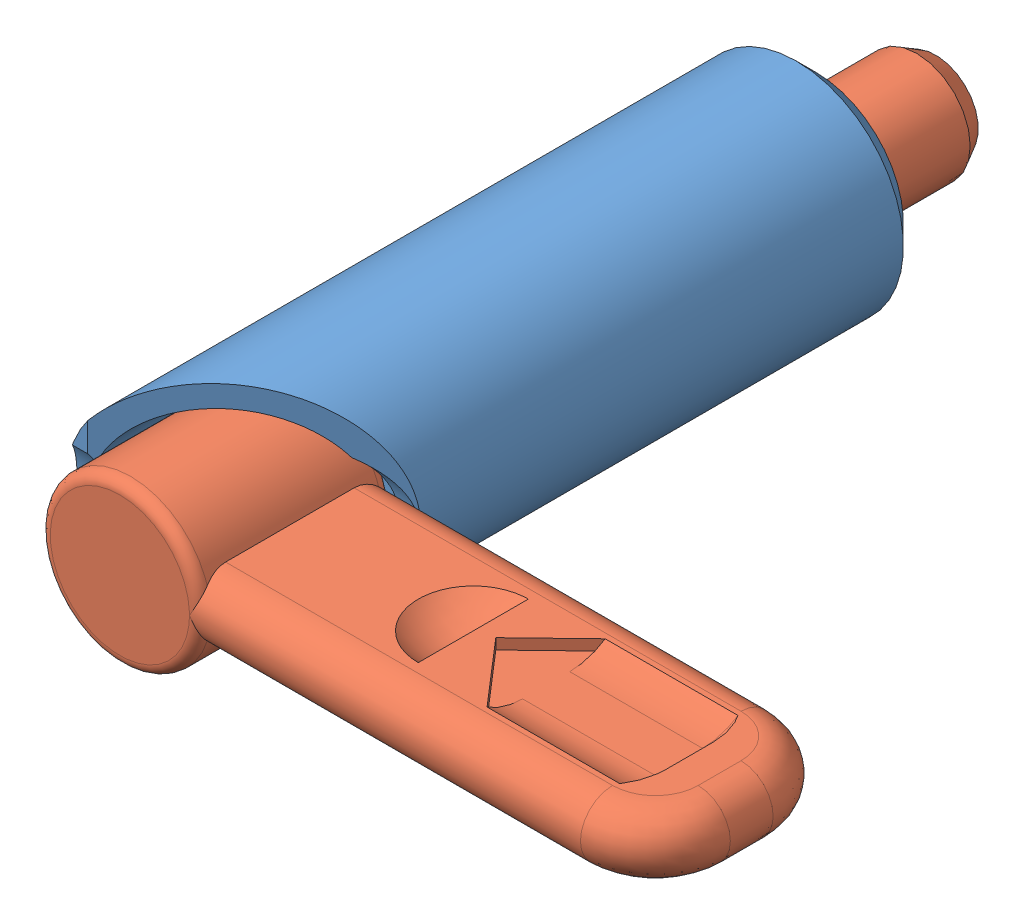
SolidWorks assembly GDX10L-5N.sldasm, configuration Default (file format 15000). Lengths in mm.
Overall size (30 10.01 38.5).
2 component instances, 2 part files, 0 mates.
Components (placement in the parent):
- GDX10L-5N_01-1: GDX10L-5N_01.SLDPRT [ﾃﾞﾌｫﾙﾄ] x (1 0 0) z (0 -1 0) size (10.01 31.09 10.01)
- GDX10L-5N_02-1: GDX10L-5N_02.SLDPRT [ﾃﾞﾌｫﾙﾄ] x (1 0 0) z (0 -1 0) size (28.75 38.5 7.5)
